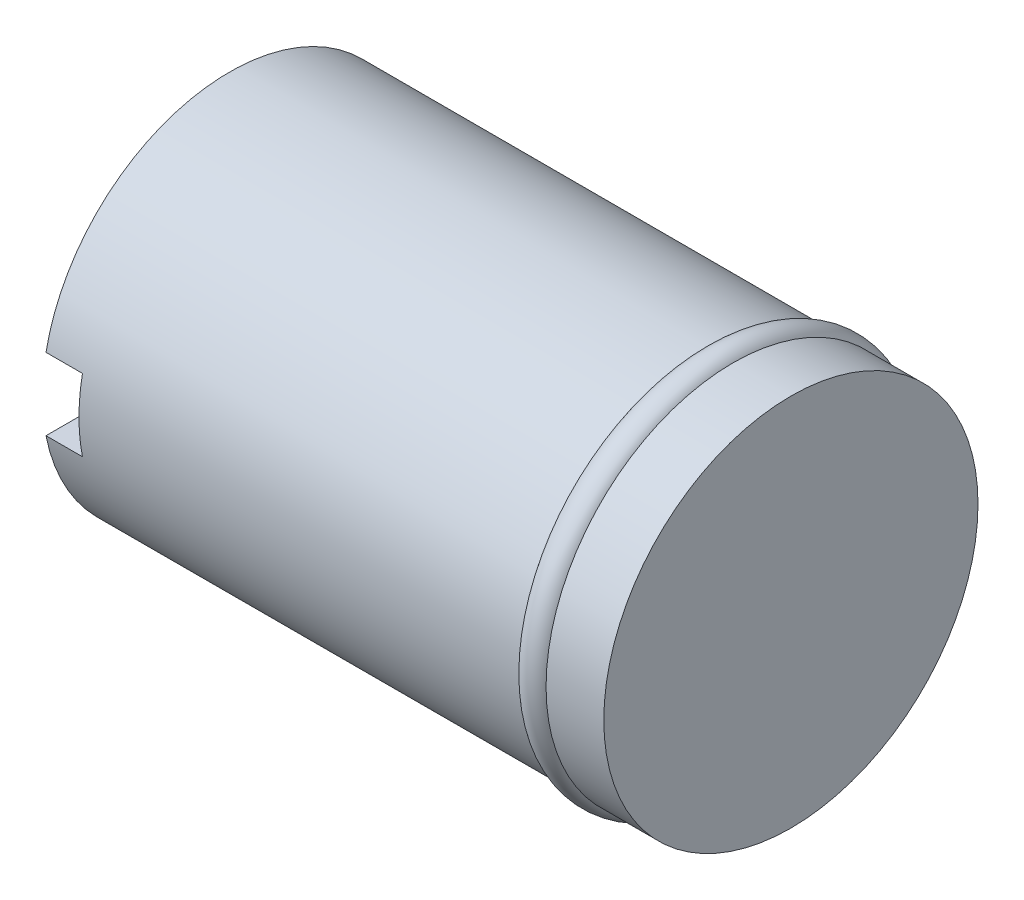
ISO-10303-21;
HEADER;
FILE_DESCRIPTION(('STEP AP214'),'2;1');
FILE_NAME('part.step','',(''),(''),'','','');
FILE_SCHEMA(('AUTOMOTIVE_DESIGN { 1 0 10303 214 1 1 1 1 }'));
ENDSEC;
DATA;
#1=APPLICATION_CONTEXT('core data for automotive mechanical design processes');
#2=APPLICATION_PROTOCOL_DEFINITION('international standard','automotive_design',2000,#1);
#3=PRODUCT_CONTEXT('',#1,'mechanical');
#4=PRODUCT('Part','Part','',(#3));
#5=PRODUCT_RELATED_PRODUCT_CATEGORY('part','',(#4));
#6=PRODUCT_DEFINITION_FORMATION('','',#4);
#7=PRODUCT_DEFINITION_CONTEXT('part definition',#1,'design');
#8=PRODUCT_DEFINITION('design','',#6,#7);
#9=PRODUCT_DEFINITION_SHAPE('','',#8);
#10=(LENGTH_UNIT() NAMED_UNIT(*) SI_UNIT(.MILLI.,.METRE.));
#11=(NAMED_UNIT(*) PLANE_ANGLE_UNIT() SI_UNIT($,.RADIAN.));
#12=(NAMED_UNIT(*) SI_UNIT($,.STERADIAN.) SOLID_ANGLE_UNIT());
#13=UNCERTAINTY_MEASURE_WITH_UNIT(LENGTH_MEASURE(1.E-05),#10,'distance_accuracy_value','');
#14=(GEOMETRIC_REPRESENTATION_CONTEXT(3) GLOBAL_UNCERTAINTY_ASSIGNED_CONTEXT((#13)) GLOBAL_UNIT_ASSIGNED_CONTEXT((#10,
#11,#12)) REPRESENTATION_CONTEXT('',''));
#15=CARTESIAN_POINT('',(0.,0.,0.));
#16=DIRECTION('',(0.,0.,1.));
#17=DIRECTION('',(1.,0.,0.));
#18=AXIS2_PLACEMENT_3D('',#15,#16,#17);
#19=CARTESIAN_POINT('',(0.,0.,0.));
#20=DIRECTION('',(1.,0.,0.));
#21=DIRECTION('',(0.,0.,-1.));
#22=AXIS2_PLACEMENT_3D('',#19,#20,#21);
#23=PLANE('',#22);
#24=CARTESIAN_POINT('',(0.,0.,0.));
#25=DIRECTION('',(-1.,0.,0.));
#26=DIRECTION('',(0.,0.,1.));
#27=AXIS2_PLACEMENT_3D('',#24,#25,#26);
#28=CIRCLE('',#27,5.);
#29=CARTESIAN_POINT('',(0.,-0.964181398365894,-4.90615472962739));
#30=VERTEX_POINT('',#29);
#31=CARTESIAN_POINT('',(0.,-0.964181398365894,4.90615472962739));
#32=VERTEX_POINT('',#31);
#33=EDGE_CURVE('E81',#30,#32,#28,.T.);
#34=ORIENTED_EDGE('',*,*,#33,.T.);
#35=DIRECTION('',(0.,0.,-1.));
#36=VECTOR('',#35,1.);
#37=CARTESIAN_POINT('',(0.,-0.964181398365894,0.));
#38=LINE('',#37,#36);
#39=EDGE_CURVE('E39',#32,#30,#38,.T.);
#40=ORIENTED_EDGE('',*,*,#39,.T.);
#41=EDGE_LOOP('',(#34,#40));
#42=FACE_BOUND('',#41,.T.);
#43=ADVANCED_FACE('F16',(#42),#23,.F.);
#44=CARTESIAN_POINT('',(0.,0.964181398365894,4.90615472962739));
#45=VERTEX_POINT('',#44);
#46=CARTESIAN_POINT('',(0.,0.964181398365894,-4.90615472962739));
#47=VERTEX_POINT('',#46);
#48=EDGE_CURVE('E80',#45,#47,#28,.T.);
#49=ORIENTED_EDGE('',*,*,#48,.T.);
#50=DIRECTION('',(0.,0.,1.));
#51=VECTOR('',#50,1.);
#52=CARTESIAN_POINT('',(0.,0.964181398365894,0.));
#53=LINE('',#52,#51);
#54=EDGE_CURVE('E58',#47,#45,#53,.T.);
#55=ORIENTED_EDGE('',*,*,#54,.T.);
#56=EDGE_LOOP('',(#49,#55));
#57=FACE_BOUND('',#56,.T.);
#58=ADVANCED_FACE('F18',(#57),#23,.F.);
#59=CARTESIAN_POINT('',(0.,0.,0.));
#60=DIRECTION('',(-1.,0.,0.));
#61=DIRECTION('',(0.,0.,1.));
#62=AXIS2_PLACEMENT_3D('',#59,#60,#61);
#63=CYLINDRICAL_SURFACE('',#62,5.);
#64=ORIENTED_EDGE('',*,*,#33,.F.);
#65=DIRECTION('',(-1.,0.,0.));
#66=VECTOR('',#65,1.);
#67=CARTESIAN_POINT('',(0.,-0.964181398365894,-4.90615472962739));
#68=LINE('',#67,#66);
#69=CARTESIAN_POINT('',(0.974420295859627,-0.964181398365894,-4.90615472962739));
#70=VERTEX_POINT('',#69);
#71=EDGE_CURVE('E10',#30,#70,#68,.F.);
#72=ORIENTED_EDGE('',*,*,#71,.T.);
#73=CARTESIAN_POINT('',(0.974420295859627,0.,0.));
#74=DIRECTION('',(1.,0.,0.));
#75=DIRECTION('',(0.,0.,-1.));
#76=AXIS2_PLACEMENT_3D('',#73,#74,#75);
#77=CIRCLE('',#76,5.);
#78=CARTESIAN_POINT('',(0.974420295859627,0.964181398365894,-4.90615472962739));
#79=VERTEX_POINT('',#78);
#80=EDGE_CURVE('E24',#70,#79,#77,.T.);
#81=ORIENTED_EDGE('',*,*,#80,.T.);
#82=DIRECTION('',(-1.,0.,0.));
#83=VECTOR('',#82,1.);
#84=CARTESIAN_POINT('',(0.,0.964181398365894,-4.90615472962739));
#85=LINE('',#84,#83);
#86=EDGE_CURVE('E55',#79,#47,#85,.T.);
#87=ORIENTED_EDGE('',*,*,#86,.T.);
#88=ORIENTED_EDGE('',*,*,#48,.F.);
#89=DIRECTION('',(-1.,0.,0.));
#90=VECTOR('',#89,1.);
#91=CARTESIAN_POINT('',(0.,0.964181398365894,4.90615472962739));
#92=LINE('',#91,#90);
#93=CARTESIAN_POINT('',(0.974420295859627,0.964181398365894,4.90615472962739));
#94=VERTEX_POINT('',#93);
#95=EDGE_CURVE('E79',#45,#94,#92,.F.);
#96=ORIENTED_EDGE('',*,*,#95,.T.);
#97=CARTESIAN_POINT('',(0.974420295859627,-0.964181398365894,4.90615472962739));
#98=VERTEX_POINT('',#97);
#99=EDGE_CURVE('E69',#94,#98,#77,.T.);
#100=ORIENTED_EDGE('',*,*,#99,.T.);
#101=DIRECTION('',(-1.,0.,0.));
#102=VECTOR('',#101,1.);
#103=CARTESIAN_POINT('',(0.,-0.964181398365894,4.90615472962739));
#104=LINE('',#103,#102);
#105=EDGE_CURVE('E63',#98,#32,#104,.T.);
#106=ORIENTED_EDGE('',*,*,#105,.T.);
#107=EDGE_LOOP('',(#64,#72,#81,#87,#88,#96,#100,#106));
#108=FACE_BOUND('',#107,.T.);
#109=CARTESIAN_POINT('',(12.7392093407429,0.,0.));
#110=DIRECTION('',(-1.,0.,0.));
#111=DIRECTION('',(0.,0.,1.));
#112=AXIS2_PLACEMENT_3D('',#109,#110,#111);
#113=CIRCLE('',#112,5.);
#114=CARTESIAN_POINT('',(12.7392093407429,0.,5.));
#115=VERTEX_POINT('',#114);
#116=EDGE_CURVE('E84',#115,#115,#113,.T.);
#117=ORIENTED_EDGE('',*,*,#116,.T.);
#118=EDGE_LOOP('',(#117));
#119=FACE_BOUND('',#118,.T.);
#120=ADVANCED_FACE('F74',(#108,#119),#63,.T.);
#121=CARTESIAN_POINT('',(13.0981836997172,0.,0.));
#122=DIRECTION('',(-1.,0.,0.));
#123=DIRECTION('',(0.,0.,1.));
#124=AXIS2_PLACEMENT_3D('',#121,#122,#123);
#125=TOROIDAL_SURFACE('',#124,4.75215608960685,0.43622149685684);
#126=ORIENTED_EDGE('',*,*,#116,.F.);
#127=EDGE_LOOP('',(#126));
#128=FACE_BOUND('',#127,.T.);
#129=CARTESIAN_POINT('',(13.4571580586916,0.,0.));
#130=DIRECTION('',(-1.,0.,0.));
#131=DIRECTION('',(0.,0.,1.));
#132=AXIS2_PLACEMENT_3D('',#129,#130,#131);
#133=CIRCLE('',#132,5.);
#134=CARTESIAN_POINT('',(13.4571580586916,0.,5.));
#135=VERTEX_POINT('',#134);
#136=EDGE_CURVE('E87',#135,#135,#133,.T.);
#137=ORIENTED_EDGE('',*,*,#136,.T.);
#138=EDGE_LOOP('',(#137));
#139=FACE_BOUND('',#138,.T.);
#140=ADVANCED_FACE('F109',(#128,#139),#125,.T.);
#141=CARTESIAN_POINT('',(0.,0.,0.));
#142=DIRECTION('',(-1.,0.,0.));
#143=DIRECTION('',(0.,0.,1.));
#144=AXIS2_PLACEMENT_3D('',#141,#142,#143);
#145=CYLINDRICAL_SURFACE('',#144,5.);
#146=ORIENTED_EDGE('',*,*,#136,.F.);
#147=EDGE_LOOP('',(#146));
#148=FACE_BOUND('',#147,.T.);
#149=CARTESIAN_POINT('',(15.,0.,0.));
#150=DIRECTION('',(-1.,0.,0.));
#151=DIRECTION('',(0.,0.,1.));
#152=AXIS2_PLACEMENT_3D('',#149,#150,#151);
#153=CIRCLE('',#152,5.);
#154=CARTESIAN_POINT('',(15.,0.,5.));
#155=VERTEX_POINT('',#154);
#156=EDGE_CURVE('E90',#155,#155,#153,.T.);
#157=ORIENTED_EDGE('',*,*,#156,.T.);
#158=EDGE_LOOP('',(#157));
#159=FACE_BOUND('',#158,.T.);
#160=ADVANCED_FACE('F114',(#148,#159),#145,.T.);
#161=CARTESIAN_POINT('',(15.,5.,0.));
#162=DIRECTION('',(-1.,0.,0.));
#163=DIRECTION('',(0.,0.,1.));
#164=AXIS2_PLACEMENT_3D('',#161,#162,#163);
#165=PLANE('',#164);
#166=ORIENTED_EDGE('',*,*,#156,.F.);
#167=EDGE_LOOP('',(#166));
#168=FACE_BOUND('',#167,.T.);
#169=ADVANCED_FACE('F120',(#168),#165,.F.);
#170=CARTESIAN_POINT('',(0.974420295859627,-0.964181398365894,-5.18837758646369));
#171=DIRECTION('',(1.,0.,0.));
#172=DIRECTION('',(0.,0.,-1.));
#173=AXIS2_PLACEMENT_3D('',#170,#171,#172);
#174=PLANE('',#173);
#175=DIRECTION('',(0.,0.,1.));
#176=VECTOR('',#175,1.);
#177=CARTESIAN_POINT('',(0.974420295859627,0.964181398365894,-5.18837758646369));
#178=LINE('',#177,#176);
#179=EDGE_CURVE('E31',#79,#94,#178,.T.);
#180=ORIENTED_EDGE('',*,*,#179,.F.);
#181=ORIENTED_EDGE('',*,*,#80,.F.);
#182=DIRECTION('',(0.,0.,1.));
#183=VECTOR('',#182,1.);
#184=CARTESIAN_POINT('',(0.974420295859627,-0.964181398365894,-5.18837758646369));
#185=LINE('',#184,#183);
#186=EDGE_CURVE('E71',#70,#98,#185,.T.);
#187=ORIENTED_EDGE('',*,*,#186,.T.);
#188=ORIENTED_EDGE('',*,*,#99,.F.);
#189=EDGE_LOOP('',(#180,#181,#187,#188));
#190=FACE_BOUND('',#189,.T.);
#191=ADVANCED_FACE('F65',(#190),#174,.F.);
#192=CARTESIAN_POINT('',(-0.974420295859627,-0.964181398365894,-5.18837758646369));
#193=DIRECTION('',(0.,-1.,0.));
#194=DIRECTION('',(0.,0.,-1.));
#195=AXIS2_PLACEMENT_3D('',#192,#193,#194);
#196=PLANE('',#195);
#197=ORIENTED_EDGE('',*,*,#186,.F.);
#198=ORIENTED_EDGE('',*,*,#71,.F.);
#199=ORIENTED_EDGE('',*,*,#39,.F.);
#200=ORIENTED_EDGE('',*,*,#105,.F.);
#201=EDGE_LOOP('',(#197,#198,#199,#200));
#202=FACE_BOUND('',#201,.T.);
#203=ADVANCED_FACE('F95',(#202),#196,.F.);
#204=CARTESIAN_POINT('',(-0.974420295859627,0.964181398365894,-5.18837758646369));
#205=DIRECTION('',(0.,1.,0.));
#206=DIRECTION('',(0.,0.,1.));
#207=AXIS2_PLACEMENT_3D('',#204,#205,#206);
#208=PLANE('',#207);
#209=ORIENTED_EDGE('',*,*,#179,.T.);
#210=ORIENTED_EDGE('',*,*,#95,.F.);
#211=ORIENTED_EDGE('',*,*,#54,.F.);
#212=ORIENTED_EDGE('',*,*,#86,.F.);
#213=EDGE_LOOP('',(#209,#210,#211,#212));
#214=FACE_BOUND('',#213,.T.);
#215=ADVANCED_FACE('F56',(#214),#208,.F.);
#216=CLOSED_SHELL('',(#43,#58,#120,#140,#160,#169,#191,#203,#215));
#217=MANIFOLD_SOLID_BREP('B1',#216);
#218=ADVANCED_BREP_SHAPE_REPRESENTATION('',(#18,#217),#14);
#219=SHAPE_DEFINITION_REPRESENTATION(#9,#218);
ENDSEC;
END-ISO-10303-21;
